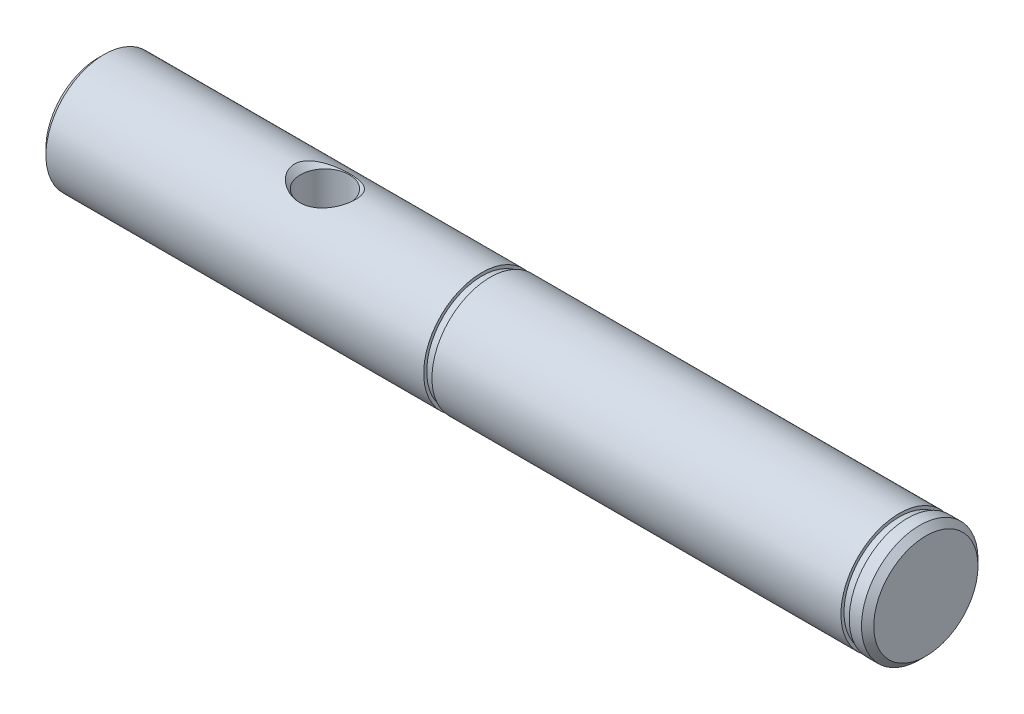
ISO-10303-21;
HEADER;
FILE_DESCRIPTION(('STEP AP214'),'2;1');
FILE_NAME('part.step','',(''),(''),'','','');
FILE_SCHEMA(('AUTOMOTIVE_DESIGN { 1 0 10303 214 1 1 1 1 }'));
ENDSEC;
DATA;
#1=APPLICATION_CONTEXT('core data for automotive mechanical design processes');
#2=APPLICATION_PROTOCOL_DEFINITION('international standard','automotive_design',2000,#1);
#3=PRODUCT_CONTEXT('',#1,'mechanical');
#4=PRODUCT('Part','Part','',(#3));
#5=PRODUCT_RELATED_PRODUCT_CATEGORY('part','',(#4));
#6=PRODUCT_DEFINITION_FORMATION('','',#4);
#7=PRODUCT_DEFINITION_CONTEXT('part definition',#1,'design');
#8=PRODUCT_DEFINITION('design','',#6,#7);
#9=PRODUCT_DEFINITION_SHAPE('','',#8);
#10=(LENGTH_UNIT() NAMED_UNIT(*) SI_UNIT(.MILLI.,.METRE.));
#11=(NAMED_UNIT(*) PLANE_ANGLE_UNIT() SI_UNIT($,.RADIAN.));
#12=(NAMED_UNIT(*) SI_UNIT($,.STERADIAN.) SOLID_ANGLE_UNIT());
#13=UNCERTAINTY_MEASURE_WITH_UNIT(LENGTH_MEASURE(1.E-05),#10,'distance_accuracy_value','');
#14=(GEOMETRIC_REPRESENTATION_CONTEXT(3) GLOBAL_UNCERTAINTY_ASSIGNED_CONTEXT((#13)) GLOBAL_UNIT_ASSIGNED_CONTEXT((#10,
#11,#12)) REPRESENTATION_CONTEXT('',''));
#15=CARTESIAN_POINT('',(0.,0.,0.));
#16=DIRECTION('',(0.,0.,1.));
#17=DIRECTION('',(1.,0.,0.));
#18=AXIS2_PLACEMENT_3D('',#15,#16,#17);
#19=CARTESIAN_POINT('',(1101.68249168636,472.076383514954,0.));
#20=DIRECTION('',(-1.,0.,0.));
#21=DIRECTION('',(0.,0.,1.));
#22=AXIS2_PLACEMENT_3D('',#19,#20,#21);
#23=CONICAL_SURFACE('',#22,8.5,0.785398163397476);
#24=CARTESIAN_POINT('',(1100.68249168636,472.076383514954,0.));
#25=DIRECTION('',(1.,0.,0.));
#26=DIRECTION('',(0.,0.,-1.));
#27=AXIS2_PLACEMENT_3D('',#24,#25,#26);
#28=CIRCLE('',#27,9.5);
#29=CARTESIAN_POINT('',(1100.68249168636,472.076383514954,-9.5));
#30=VERTEX_POINT('',#29);
#31=EDGE_CURVE('E28',#30,#30,#28,.T.);
#32=ORIENTED_EDGE('',*,*,#31,.T.);
#33=EDGE_LOOP('',(#32));
#34=FACE_BOUND('',#33,.T.);
#35=CARTESIAN_POINT('',(1101.68249168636,472.076383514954,0.));
#36=DIRECTION('',(1.,0.,0.));
#37=DIRECTION('',(0.,0.,-1.));
#38=AXIS2_PLACEMENT_3D('',#35,#36,#37);
#39=CIRCLE('',#38,8.5);
#40=CARTESIAN_POINT('',(1101.68249168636,472.076383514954,-8.5));
#41=VERTEX_POINT('',#40);
#42=EDGE_CURVE('E85',#41,#41,#39,.T.);
#43=ORIENTED_EDGE('',*,*,#42,.F.);
#44=EDGE_LOOP('',(#43));
#45=FACE_BOUND('',#44,.T.);
#46=ADVANCED_FACE('F14',(#34,#45),#23,.T.);
#47=CARTESIAN_POINT('',(1107.79950179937,472.076383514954,0.));
#48=DIRECTION('',(1.,0.,0.));
#49=DIRECTION('',(0.,0.,-1.));
#50=AXIS2_PLACEMENT_3D('',#47,#48,#49);
#51=CYLINDRICAL_SURFACE('',#50,9.5);
#52=CARTESIAN_POINT('',(1098.68249168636,472.076383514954,0.));
#53=DIRECTION('',(1.,0.,0.));
#54=DIRECTION('',(0.,0.,-1.));
#55=AXIS2_PLACEMENT_3D('',#52,#53,#54);
#56=CIRCLE('',#55,9.5);
#57=CARTESIAN_POINT('',(1098.68249168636,472.076383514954,-9.5));
#58=VERTEX_POINT('',#57);
#59=EDGE_CURVE('E32',#58,#58,#56,.T.);
#60=ORIENTED_EDGE('',*,*,#59,.T.);
#61=EDGE_LOOP('',(#60));
#62=FACE_BOUND('',#61,.T.);
#63=ORIENTED_EDGE('',*,*,#31,.F.);
#64=EDGE_LOOP('',(#63));
#65=FACE_BOUND('',#64,.T.);
#66=ADVANCED_FACE('F73',(#62,#65),#51,.T.);
#67=CARTESIAN_POINT('',(1098.68249168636,481.076383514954,0.));
#68=DIRECTION('',(-1.,0.,0.));
#69=DIRECTION('',(0.,0.,1.));
#70=AXIS2_PLACEMENT_3D('',#67,#68,#69);
#71=PLANE('',#70);
#72=CARTESIAN_POINT('',(1098.68249168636,472.076383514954,0.));
#73=DIRECTION('',(1.,0.,0.));
#74=DIRECTION('',(0.,0.,-1.));
#75=AXIS2_PLACEMENT_3D('',#72,#73,#74);
#76=CIRCLE('',#75,9.);
#77=CARTESIAN_POINT('',(1098.68249168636,472.076383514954,-9.));
#78=VERTEX_POINT('',#77);
#79=EDGE_CURVE('E116',#78,#78,#76,.T.);
#80=ORIENTED_EDGE('',*,*,#79,.T.);
#81=EDGE_LOOP('',(#80));
#82=FACE_BOUND('',#81,.T.);
#83=ORIENTED_EDGE('',*,*,#59,.F.);
#84=EDGE_LOOP('',(#83));
#85=FACE_BOUND('',#84,.T.);
#86=ADVANCED_FACE('F79',(#82,#85),#71,.T.);
#87=CARTESIAN_POINT('',(1107.79950179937,472.076383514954,0.));
#88=DIRECTION('',(1.,0.,0.));
#89=DIRECTION('',(0.,0.,-1.));
#90=AXIS2_PLACEMENT_3D('',#87,#88,#89);
#91=CYLINDRICAL_SURFACE('',#90,9.);
#92=CARTESIAN_POINT('',(1097.33249168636,472.076383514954,0.));
#93=DIRECTION('',(1.,0.,0.));
#94=DIRECTION('',(0.,0.,-1.));
#95=AXIS2_PLACEMENT_3D('',#92,#93,#94);
#96=CIRCLE('',#95,9.);
#97=CARTESIAN_POINT('',(1097.33249168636,472.076383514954,-9.));
#98=VERTEX_POINT('',#97);
#99=EDGE_CURVE('E113',#98,#98,#96,.T.);
#100=ORIENTED_EDGE('',*,*,#99,.T.);
#101=EDGE_LOOP('',(#100));
#102=FACE_BOUND('',#101,.T.);
#103=ORIENTED_EDGE('',*,*,#79,.F.);
#104=EDGE_LOOP('',(#103));
#105=FACE_BOUND('',#104,.T.);
#106=ADVANCED_FACE('F123',(#102,#105),#91,.T.);
#107=CARTESIAN_POINT('',(1097.33249168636,481.076383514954,0.));
#108=DIRECTION('',(1.,0.,0.));
#109=DIRECTION('',(0.,0.,-1.));
#110=AXIS2_PLACEMENT_3D('',#107,#108,#109);
#111=PLANE('',#110);
#112=CARTESIAN_POINT('',(1097.33249168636,472.076383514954,0.));
#113=DIRECTION('',(1.,0.,0.));
#114=DIRECTION('',(0.,0.,-1.));
#115=AXIS2_PLACEMENT_3D('',#112,#113,#114);
#116=CIRCLE('',#115,9.5);
#117=CARTESIAN_POINT('',(1097.33249168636,472.076383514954,-9.5));
#118=VERTEX_POINT('',#117);
#119=EDGE_CURVE('E110',#118,#118,#116,.T.);
#120=ORIENTED_EDGE('',*,*,#119,.T.);
#121=EDGE_LOOP('',(#120));
#122=FACE_BOUND('',#121,.T.);
#123=ORIENTED_EDGE('',*,*,#99,.F.);
#124=EDGE_LOOP('',(#123));
#125=FACE_BOUND('',#124,.T.);
#126=ADVANCED_FACE('F130',(#122,#125),#111,.T.);
#127=CARTESIAN_POINT('',(1107.79950179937,472.076383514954,0.));
#128=DIRECTION('',(1.,0.,0.));
#129=DIRECTION('',(0.,0.,-1.));
#130=AXIS2_PLACEMENT_3D('',#127,#128,#129);
#131=CYLINDRICAL_SURFACE('',#130,9.5);
#132=CARTESIAN_POINT('',(1030.63249168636,472.076383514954,0.));
#133=DIRECTION('',(1.,0.,0.));
#134=DIRECTION('',(0.,0.,-1.));
#135=AXIS2_PLACEMENT_3D('',#132,#133,#134);
#136=CIRCLE('',#135,9.5);
#137=CARTESIAN_POINT('',(1030.63249168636,472.076383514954,-9.5));
#138=VERTEX_POINT('',#137);
#139=EDGE_CURVE('E107',#138,#138,#136,.T.);
#140=ORIENTED_EDGE('',*,*,#139,.T.);
#141=EDGE_LOOP('',(#140));
#142=FACE_BOUND('',#141,.T.);
#143=ORIENTED_EDGE('',*,*,#119,.F.);
#144=EDGE_LOOP('',(#143));
#145=FACE_BOUND('',#144,.T.);
#146=ADVANCED_FACE('F136',(#142,#145),#131,.T.);
#147=CARTESIAN_POINT('',(1030.63249168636,481.076383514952,0.));
#148=DIRECTION('',(-1.,0.,0.));
#149=DIRECTION('',(0.,0.,1.));
#150=AXIS2_PLACEMENT_3D('',#147,#148,#149);
#151=PLANE('',#150);
#152=CARTESIAN_POINT('',(1030.63249168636,472.076383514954,0.));
#153=DIRECTION('',(1.,0.,0.));
#154=DIRECTION('',(0.,0.,-1.));
#155=AXIS2_PLACEMENT_3D('',#152,#153,#154);
#156=CIRCLE('',#155,8.99999999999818);
#157=CARTESIAN_POINT('',(1030.63249168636,472.076383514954,-8.99999999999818));
#158=VERTEX_POINT('',#157);
#159=EDGE_CURVE('E104',#158,#158,#156,.T.);
#160=ORIENTED_EDGE('',*,*,#159,.T.);
#161=EDGE_LOOP('',(#160));
#162=FACE_BOUND('',#161,.T.);
#163=ORIENTED_EDGE('',*,*,#139,.F.);
#164=EDGE_LOOP('',(#163));
#165=FACE_BOUND('',#164,.T.);
#166=ADVANCED_FACE('F140',(#162,#165),#151,.T.);
#167=CARTESIAN_POINT('',(1107.79950179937,472.076383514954,0.));
#168=DIRECTION('',(1.,0.,0.));
#169=DIRECTION('',(0.,0.,-1.));
#170=AXIS2_PLACEMENT_3D('',#167,#168,#169);
#171=CYLINDRICAL_SURFACE('',#170,8.99999999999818);
#172=CARTESIAN_POINT('',(1029.28249168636,472.076383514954,0.));
#173=DIRECTION('',(1.,0.,0.));
#174=DIRECTION('',(0.,0.,-1.));
#175=AXIS2_PLACEMENT_3D('',#172,#173,#174);
#176=CIRCLE('',#175,8.99999999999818);
#177=CARTESIAN_POINT('',(1029.28249168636,472.076383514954,-8.99999999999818));
#178=VERTEX_POINT('',#177);
#179=EDGE_CURVE('E101',#178,#178,#176,.T.);
#180=ORIENTED_EDGE('',*,*,#179,.T.);
#181=EDGE_LOOP('',(#180));
#182=FACE_BOUND('',#181,.T.);
#183=ORIENTED_EDGE('',*,*,#159,.F.);
#184=EDGE_LOOP('',(#183));
#185=FACE_BOUND('',#184,.T.);
#186=ADVANCED_FACE('F144',(#182,#185),#171,.T.);
#187=CARTESIAN_POINT('',(1029.28249168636,481.076383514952,0.));
#188=DIRECTION('',(1.,0.,0.));
#189=DIRECTION('',(0.,0.,-1.));
#190=AXIS2_PLACEMENT_3D('',#187,#188,#189);
#191=PLANE('',#190);
#192=CARTESIAN_POINT('',(1029.28249168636,472.076383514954,0.));
#193=DIRECTION('',(1.,0.,0.));
#194=DIRECTION('',(0.,0.,-1.));
#195=AXIS2_PLACEMENT_3D('',#192,#193,#194);
#196=CIRCLE('',#195,9.5);
#197=CARTESIAN_POINT('',(1029.28249168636,472.076383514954,-9.5));
#198=VERTEX_POINT('',#197);
#199=EDGE_CURVE('E98',#198,#198,#196,.T.);
#200=ORIENTED_EDGE('',*,*,#199,.T.);
#201=EDGE_LOOP('',(#200));
#202=FACE_BOUND('',#201,.T.);
#203=ORIENTED_EDGE('',*,*,#179,.F.);
#204=EDGE_LOOP('',(#203));
#205=FACE_BOUND('',#204,.T.);
#206=ADVANCED_FACE('F68',(#202,#205),#191,.T.);
#207=CARTESIAN_POINT('',(1107.79950179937,472.076383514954,0.));
#208=DIRECTION('',(1.,0.,0.));
#209=DIRECTION('',(0.,0.,-1.));
#210=AXIS2_PLACEMENT_3D('',#207,#208,#209);
#211=CYLINDRICAL_SURFACE('',#210,9.5);
#212=CARTESIAN_POINT('',(1000.37403693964,481.074378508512,-3.04730801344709));
#213=CARTESIAN_POINT('',(1000.19727511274,481.117710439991,-2.91935872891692));
#214=CARTESIAN_POINT('',(1000.02917467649,481.161981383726,-2.77970118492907));
#215=CARTESIAN_POINT('',(999.714703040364,481.249078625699,-2.47717407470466));
#216=CARTESIAN_POINT('',(999.568327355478,481.291905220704,-2.31430931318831));
#217=CARTESIAN_POINT('',(999.313974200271,481.368998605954,-1.98093142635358));
#218=CARTESIAN_POINT('',(999.20381103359,481.403681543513,-1.81219250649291));
#219=CARTESIAN_POINT('',(999.011513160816,481.465559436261,-1.45791499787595));
#220=CARTESIAN_POINT('',(998.929363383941,481.492758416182,-1.27238551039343));
#221=CARTESIAN_POINT('',(998.830822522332,481.525788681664,-0.984014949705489));
#222=CARTESIAN_POINT('',(998.802014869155,481.535530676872,-0.885736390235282));
#223=CARTESIAN_POINT('',(998.753389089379,481.552052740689,-0.686754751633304));
#224=CARTESIAN_POINT('',(998.733566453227,481.558834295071,-0.586052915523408));
#225=CARTESIAN_POINT('',(998.703343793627,481.569198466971,-0.383117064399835));
#226=CARTESIAN_POINT('',(998.692939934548,481.57278238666,-0.280883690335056));
#227=CARTESIAN_POINT('',(998.681760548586,481.576635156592,-0.0758644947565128));
#228=CARTESIAN_POINT('',(998.680983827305,481.576904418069,0.0269212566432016));
#229=CARTESIAN_POINT('',(998.692138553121,481.573055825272,0.308189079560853));
#230=CARTESIAN_POINT('',(998.713911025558,481.565540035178,0.486336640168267));
#231=CARTESIAN_POINT('',(998.785389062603,481.54114872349,0.83610471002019));
#232=CARTESIAN_POINT('',(998.835096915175,481.524272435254,1.00772468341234));
#233=CARTESIAN_POINT('',(998.95988881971,481.482672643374,1.3417373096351));
#234=CARTESIAN_POINT('',(999.035145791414,481.457895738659,1.50405803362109));
#235=CARTESIAN_POINT('',(999.207346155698,481.402613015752,1.81564069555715));
#236=CARTESIAN_POINT('',(999.304303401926,481.372103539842,1.9648942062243));
#237=CARTESIAN_POINT('',(999.561972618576,481.293628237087,2.3099206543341));
#238=CARTESIAN_POINT('',(999.732193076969,481.243787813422,2.49818929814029));
#239=CARTESIAN_POINT('',(1000.10128621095,481.142579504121,2.84370371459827));
#240=CARTESIAN_POINT('',(1000.30020391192,481.091209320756,3.00089979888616));
#241=CARTESIAN_POINT('',(1000.72278025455,480.991392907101,3.28567424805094));
#242=CARTESIAN_POINT('',(1000.9467338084,480.942994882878,3.41282907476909));
#243=CARTESIAN_POINT('',(1001.41172634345,480.854453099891,3.63452745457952));
#244=CARTESIAN_POINT('',(1001.65276185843,480.814307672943,3.7290776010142));
#245=CARTESIAN_POINT('',(1002.04319781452,480.760370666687,3.85237055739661));
#246=CARTESIAN_POINT('',(1002.18869226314,480.742583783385,3.89208918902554));
#247=CARTESIAN_POINT('',(1002.48277058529,480.711649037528,3.96025323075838));
#248=CARTESIAN_POINT('',(1002.63135360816,480.698499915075,3.98870170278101));
#249=CARTESIAN_POINT('',(1002.93065110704,480.677292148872,4.03422847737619));
#250=CARTESIAN_POINT('',(1003.08136621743,480.669235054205,4.05130331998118));
#251=CARTESIAN_POINT('',(1003.3838457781,480.65849920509,4.07399671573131));
#252=CARTESIAN_POINT('',(1003.53561020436,480.655820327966,4.07961553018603));
#253=CARTESIAN_POINT('',(1003.84116465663,480.655938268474,4.07936776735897));
#254=CARTESIAN_POINT('',(1003.99495455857,480.658808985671,4.07334618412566));
#255=CARTESIAN_POINT('',(1004.30141741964,480.670067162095,4.04953972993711));
#256=CARTESIAN_POINT('',(1004.45409034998,480.678454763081,4.03175455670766));
#257=CARTESIAN_POINT('',(1004.7572874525,480.700450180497,3.98448973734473));
#258=CARTESIAN_POINT('',(1004.90781100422,480.714059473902,3.95500678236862));
#259=CARTESIAN_POINT('',(1005.20562415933,480.746009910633,3.88446291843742));
#260=CARTESIAN_POINT('',(1005.35291254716,480.764352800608,3.84339773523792));
#261=CARTESIAN_POINT('',(1005.78834376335,480.825576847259,3.7030018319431));
#262=CARTESIAN_POINT('',(1006.0702923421,480.874672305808,3.58643359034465));
#263=CARTESIAN_POINT('',(1006.60877185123,480.98300773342,3.30820602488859));
#264=CARTESIAN_POINT('',(1006.86531439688,481.042243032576,3.14656743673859));
#265=CARTESIAN_POINT('',(1007.29454994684,481.150618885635,2.81636534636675));
#266=CARTESIAN_POINT('',(1007.47365516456,481.199342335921,2.6559996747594));
#267=CARTESIAN_POINT('',(1007.80349432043,481.293626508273,2.30756736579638));
#268=CARTESIAN_POINT('',(1007.95427169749,481.339192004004,2.11954394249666));
#269=CARTESIAN_POINT('',(1008.19383893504,481.413979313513,1.75686678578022));
#270=CARTESIAN_POINT('',(1008.28898133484,481.444656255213,1.58672406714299));
#271=CARTESIAN_POINT('',(1008.45107875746,481.497828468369,1.23223125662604));
#272=CARTESIAN_POINT('',(1008.51805252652,481.520329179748,1.04789071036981));
#273=CARTESIAN_POINT('',(1008.61976806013,481.554787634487,0.668116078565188));
#274=CARTESIAN_POINT('',(1008.65429481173,481.566675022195,0.472616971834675));
#275=CARTESIAN_POINT('',(1008.68750527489,481.578104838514,0.0782448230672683));
#276=CARTESIAN_POINT('',(1008.68620527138,481.577652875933,-0.120626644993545));
#277=CARTESIAN_POINT('',(1008.65002665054,481.565210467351,-0.493104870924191));
#278=CARTESIAN_POINT('',(1008.61878334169,481.554469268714,-0.66712388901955));
#279=CARTESIAN_POINT('',(1008.52998302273,481.524357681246,-1.00746737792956));
#280=CARTESIAN_POINT('',(1008.47242277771,481.50498623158,-1.1737909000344));
#281=CARTESIAN_POINT('',(1008.33140612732,481.458472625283,-1.50163731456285));
#282=CARTESIAN_POINT('',(1008.24702836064,481.431057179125,-1.66272086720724));
#283=CARTESIAN_POINT('',(1008.0570603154,481.371049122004,-1.9707547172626));
#284=CARTESIAN_POINT('',(1007.9514547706,481.338452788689,-2.11769473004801));
#285=CARTESIAN_POINT('',(1007.67124323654,481.25504087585,-2.45873837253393));
#286=CARTESIAN_POINT('',(1007.48691732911,481.202603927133,-2.64449032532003));
#287=CARTESIAN_POINT('',(1007.08993968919,481.097710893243,-2.98281005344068));
#288=CARTESIAN_POINT('',(1006.87724356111,481.045254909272,-3.13532481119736));
#289=CARTESIAN_POINT('',(1006.42759076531,480.945087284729,-3.4084443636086));
#290=CARTESIAN_POINT('',(1006.1903655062,480.897442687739,-3.52862914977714));
#291=CARTESIAN_POINT('',(1005.69959874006,480.812419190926,-3.73418163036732));
#292=CARTESIAN_POINT('',(1005.44606283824,480.775036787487,-3.81956121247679));
#293=CARTESIAN_POINT('',(1005.04003582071,480.72742743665,-3.92570388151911));
#294=CARTESIAN_POINT('',(1004.89111305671,480.712441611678,-3.95845483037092));
#295=CARTESIAN_POINT('',(1004.59073144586,480.687503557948,-4.01242004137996));
#296=CARTESIAN_POINT('',(1004.43927239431,480.677551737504,-4.03363336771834));
#297=CARTESIAN_POINT('',(1004.1348736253,480.663045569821,-4.06442135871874));
#298=CARTESIAN_POINT('',(1003.98193341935,480.65849306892,-4.07399204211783));
#299=CARTESIAN_POINT('',(1003.67570726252,480.654954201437,-4.0814388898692));
#300=CARTESIAN_POINT('',(1003.52242132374,480.655967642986,-4.07931545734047));
#301=CARTESIAN_POINT('',(1003.21628183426,480.663531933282,-4.06336798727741));
#302=CARTESIAN_POINT('',(1003.06342981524,480.670094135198,-4.04951996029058));
#303=CARTESIAN_POINT('',(1002.759498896,480.688536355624,-4.01014892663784));
#304=CARTESIAN_POINT('',(1002.60842076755,480.700418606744,-3.98462101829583));
#305=CARTESIAN_POINT('',(1002.3092652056,480.72907070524,-3.92201335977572));
#306=CARTESIAN_POINT('',(1002.16118559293,480.745836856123,-3.88494234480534));
#307=CARTESIAN_POINT('',(1001.86892463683,480.783680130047,-3.79936380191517));
#308=CARTESIAN_POINT('',(1001.72474407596,480.804758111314,-3.75085399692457));
#309=CARTESIAN_POINT('',(1001.36773506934,480.862409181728,-3.61438504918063));
#310=CARTESIAN_POINT('',(1001.15806378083,480.901350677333,-3.51901146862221));
#311=CARTESIAN_POINT('',(1000.7537790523,480.984646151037,-3.30246644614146));
#312=CARTESIAN_POINT('',(1000.55915800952,481.028997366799,-3.18130814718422));
#313=CARTESIAN_POINT('',(1000.37403693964,481.074378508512,-3.04730801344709));
#314=B_SPLINE_CURVE_WITH_KNOTS('',3,(#212,#213,#214,#215,#216,#217,#218,#219,#220,#221,#222,
#223,#224,#225,#226,#227,#228,#229,#230,#231,#232,#233,#234,#235,#236,#237,#238,#239,#240,#241,
#242,#243,#244,#245,#246,#247,#248,#249,#250,#251,#252,#253,#254,#255,#256,#257,#258,#259,#260,
#261,#262,#263,#264,#265,#266,#267,#268,#269,#270,#271,#272,#273,#274,#275,#276,#277,#278,#279,
#280,#281,#282,#283,#284,#285,#286,#287,#288,#289,#290,#291,#292,#293,#294,#295,#296,#297,#298,
#299,#300,#301,#302,#303,#304,#305,#306,#307,#308,#309,#310,#311,#312,#313),.UNSPECIFIED.,.T.,
.F.,(4,2,2,2,2,2,2,2,2,2,2,2,2,2,2,2,2,2,2,2,2,2,2,2,2,2,2,2,2,2,2,2,2,2,2,2,2,2,2,2,2,2,2,2,2,
2,2,2,2,2,4),(0.,0.666922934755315,1.33370799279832,1.9448158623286,2.55559444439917,
2.86383262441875,3.17191592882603,3.47987371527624,3.7877932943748,4.32383217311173,
4.85991496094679,5.39970085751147,5.93983234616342,6.71162964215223,7.48465131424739,
8.26799569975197,9.05118158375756,9.50632153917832,9.96133775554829,10.4164923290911,
10.8716365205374,11.332883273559,11.7941418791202,12.2555310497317,12.7170907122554,
13.6394892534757,14.561464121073,15.2946186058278,16.0266395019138,16.6163013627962,
17.2055701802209,17.7987168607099,18.391593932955,18.9205513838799,19.4495738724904,
19.9992025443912,20.549227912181,21.3455964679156,22.1432261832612,22.950766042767,
23.7580298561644,24.2172148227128,24.6764370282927,25.1358162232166,25.5951795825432,
26.0554851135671,26.5159839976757,26.9761352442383,27.436378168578,28.1351959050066,
28.833658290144),.UNSPECIFIED.);
#315=CARTESIAN_POINT('',(1000.37403693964,481.074378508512,-3.04730801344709));
#316=VERTEX_POINT('',#315);
#317=EDGE_CURVE('E10',#316,#316,#314,.T.);
#318=ORIENTED_EDGE('',*,*,#317,.F.);
#319=EDGE_LOOP('',(#318));
#320=FACE_BOUND('',#319,.T.);
#321=CARTESIAN_POINT('',(1000.37403693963,463.078388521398,-3.04730801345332));
#322=CARTESIAN_POINT('',(1000.61195260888,463.136707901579,-3.21952724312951));
#323=CARTESIAN_POINT('',(1000.86576135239,463.193370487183,-3.37067627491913));
#324=CARTESIAN_POINT('',(1001.39673170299,463.296277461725,-3.63033970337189));
#325=CARTESIAN_POINT('',(1001.67393600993,463.34250220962,-3.73877400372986));
#326=CARTESIAN_POINT('',(1002.10213526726,463.399777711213,-3.86893983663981));
#327=CARTESIAN_POINT('',(1002.24755503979,463.416904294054,-3.90700240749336));
#328=CARTESIAN_POINT('',(1002.54132584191,463.446486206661,-3.97192259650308));
#329=CARTESIAN_POINT('',(1002.68967586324,463.458943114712,-3.99878400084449));
#330=CARTESIAN_POINT('',(1002.98821752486,463.478748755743,-4.04119033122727));
#331=CARTESIAN_POINT('',(1003.13840793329,463.486100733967,-4.05674244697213));
#332=CARTESIAN_POINT('',(1003.43970138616,463.495455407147,-4.07649286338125));
#333=CARTESIAN_POINT('',(1003.59080442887,463.497458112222,-4.08069118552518));
#334=CARTESIAN_POINT('',(1003.89553279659,463.496029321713,-4.07768633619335));
#335=CARTESIAN_POINT('',(1004.04915572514,463.492501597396,-4.0702812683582));
#336=CARTESIAN_POINT('',(1004.35515705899,463.479961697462,-4.04372905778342));
#337=CARTESIAN_POINT('',(1004.50753543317,463.47094938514,-4.02458162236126));
#338=CARTESIAN_POINT('',(1004.81005969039,463.447755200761,-3.97461156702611));
#339=CARTESIAN_POINT('',(1004.96020433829,463.433570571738,-3.94378272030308));
#340=CARTESIAN_POINT('',(1005.25714187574,463.400538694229,-3.87056902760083));
#341=CARTESIAN_POINT('',(1005.40393350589,463.381689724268,-3.82817991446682));
#342=CARTESIAN_POINT('',(1005.83796337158,463.319037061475,-3.68375919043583));
#343=CARTESIAN_POINT('',(1006.11882170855,463.269130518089,-3.56447992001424));
#344=CARTESIAN_POINT('',(1006.65457142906,463.159588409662,-3.28081912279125));
#345=CARTESIAN_POINT('',(1006.90947736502,463.099958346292,-3.11646306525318));
#346=CARTESIAN_POINT('',(1007.33346962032,462.991757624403,-2.78270503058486));
#347=CARTESIAN_POINT('',(1007.50929480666,462.943521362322,-2.62175422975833));
#348=CARTESIAN_POINT('',(1007.83259186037,462.850476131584,-2.27268971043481));
#349=CARTESIAN_POINT('',(1007.98010721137,462.805661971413,-2.08461843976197));
#350=CARTESIAN_POINT('',(1008.21422892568,462.732272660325,-1.72189773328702));
#351=CARTESIAN_POINT('',(1008.30709131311,462.702231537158,-1.55159755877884));
#352=CARTESIAN_POINT('',(1008.46461931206,462.650421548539,-1.19716867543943));
#353=CARTESIAN_POINT('',(1008.52930364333,462.628647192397,-1.01304924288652));
#354=CARTESIAN_POINT('',(1008.62653544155,462.595660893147,-0.634203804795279));
#355=CARTESIAN_POINT('',(1008.65887614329,462.584516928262,-0.439417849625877));
#356=CARTESIAN_POINT('',(1008.68804308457,462.574474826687,-0.0468957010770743));
#357=CARTESIAN_POINT('',(1008.68488375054,462.57557171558,0.150839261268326));
#358=CARTESIAN_POINT('',(1008.64556645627,462.589087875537,0.521594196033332));
#359=CARTESIAN_POINT('',(1008.61288107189,462.600315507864,0.695042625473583));
#360=CARTESIAN_POINT('',(1008.52142146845,462.631293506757,1.03405522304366));
#361=CARTESIAN_POINT('',(1008.46264386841,462.651044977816,1.19961836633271));
#362=CARTESIAN_POINT('',(1008.31905403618,462.69832198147,1.52658765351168));
#363=CARTESIAN_POINT('',(1008.23321426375,462.726150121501,1.68749411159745));
#364=CARTESIAN_POINT('',(1008.04038745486,462.786894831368,1.99499974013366));
#365=CARTESIAN_POINT('',(1007.9333849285,462.819815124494,2.14158831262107));
#366=CARTESIAN_POINT('',(1007.64957699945,462.903972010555,2.4819236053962));
#367=CARTESIAN_POINT('',(1007.46303294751,462.956782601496,2.66719248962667));
#368=CARTESIAN_POINT('',(1007.06168428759,463.06217005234,3.00420738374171));
#369=CARTESIAN_POINT('',(1006.84683572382,463.114746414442,3.15590024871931));
#370=CARTESIAN_POINT('',(1006.39298331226,463.214851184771,3.42700443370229));
#371=CARTESIAN_POINT('',(1006.15371650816,463.262310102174,3.54599888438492));
#372=CARTESIAN_POINT('',(1005.65899388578,463.346640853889,3.74882925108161));
#373=CARTESIAN_POINT('',(1005.40354308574,463.383515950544,3.83267600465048));
#374=CARTESIAN_POINT('',(1004.99518317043,463.430026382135,3.93600301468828));
#375=CARTESIAN_POINT('',(1004.84577861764,463.444542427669,3.96763286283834));
#376=CARTESIAN_POINT('',(1004.54453377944,463.468484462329,4.01931648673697));
#377=CARTESIAN_POINT('',(1004.39269330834,463.477910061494,4.03936937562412));
#378=CARTESIAN_POINT('',(1004.08767846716,463.491322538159,4.06779686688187));
#379=CARTESIAN_POINT('',(1003.93450398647,463.495308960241,4.07617049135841));
#380=CARTESIAN_POINT('',(1003.62792076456,463.497699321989,4.08119916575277));
#381=CARTESIAN_POINT('',(1003.47451202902,463.496103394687,4.07785449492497));
#382=CARTESIAN_POINT('',(1003.1684961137,463.487384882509,4.05945876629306));
#383=CARTESIAN_POINT('',(1003.01588927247,463.480260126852,4.04440311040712));
#384=CARTESIAN_POINT('',(1002.71261931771,463.46073972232,4.00265041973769));
#385=CARTESIAN_POINT('',(1002.56195624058,463.448343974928,3.97595316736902));
#386=CARTESIAN_POINT('',(1002.26353977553,463.418708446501,3.91100255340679));
#387=CARTESIAN_POINT('',(1002.11578784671,463.401466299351,3.87274354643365));
#388=CARTESIAN_POINT('',(1001.8242796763,463.362738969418,3.78479651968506));
#389=CARTESIAN_POINT('',(1001.68052492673,463.341252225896,3.7351042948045));
#390=CARTESIAN_POINT('',(1001.25513005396,463.271193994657,3.56838824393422));
#391=CARTESIAN_POINT('',(1000.98090845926,463.217189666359,3.43405889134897));
#392=CARTESIAN_POINT('',(1000.46153752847,463.101852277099,3.1201954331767));
#393=CARTESIAN_POINT('',(1000.21636061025,463.040526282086,2.94070472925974));
#394=CARTESIAN_POINT('',(999.822186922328,462.93426651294,2.58777387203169));
#395=CARTESIAN_POINT('',(999.664493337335,462.889080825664,2.4241169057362));
#396=CARTESIAN_POINT('',(999.377320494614,462.803472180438,2.07260396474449));
#397=CARTESIAN_POINT('',(999.247797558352,462.763041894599,1.88478618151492));
#398=CARTESIAN_POINT('',(999.043694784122,462.697686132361,1.52240309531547));
#399=CARTESIAN_POINT('',(998.963460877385,462.671284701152,1.35130179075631));
#400=CARTESIAN_POINT('',(998.831237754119,462.627208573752,0.99739173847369));
#401=CARTESIAN_POINT('',(998.779230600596,462.609528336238,0.814590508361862));
#402=CARTESIAN_POINT('',(998.706770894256,462.584776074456,0.441074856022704));
#403=CARTESIAN_POINT('',(998.686479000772,462.577758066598,0.250325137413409));
#404=CARTESIAN_POINT('',(998.679575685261,462.575378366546,-0.131846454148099));
#405=CARTESIAN_POINT('',(998.692957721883,462.580014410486,-0.323268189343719));
#406=CARTESIAN_POINT('',(998.749824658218,462.599500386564,-0.684663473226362));
#407=CARTESIAN_POINT('',(998.790731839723,462.613475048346,-0.855102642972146));
#408=CARTESIAN_POINT('',(998.897461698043,462.649360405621,-1.18707391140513));
#409=CARTESIAN_POINT('',(998.963293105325,462.671273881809,-1.34860286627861));
#410=CARTESIAN_POINT('',(999.122086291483,462.722968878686,-1.67098284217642));
#411=CARTESIAN_POINT('',(999.21664550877,462.753199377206,-1.83096742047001));
#412=CARTESIAN_POINT('',(999.426538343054,462.818200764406,-2.1354925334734));
#413=CARTESIAN_POINT('',(999.541872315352,462.852971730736,-2.28003280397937));
#414=CARTESIAN_POINT('',(999.772370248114,462.919698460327,-2.53374170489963));
#415=CARTESIAN_POINT('',(999.885307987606,462.951369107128,-2.64503103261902));
#416=CARTESIAN_POINT('',(1000.1219660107,463.014983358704,-2.85536216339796));
#417=CARTESIAN_POINT('',(1000.24568882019,463.046927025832,-2.95440108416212));
#418=CARTESIAN_POINT('',(1000.37403693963,463.078388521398,-3.04730801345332));
#419=B_SPLINE_CURVE_WITH_KNOTS('',3,(#321,#322,#323,#324,#325,#326,#327,#328,#329,#330,#331,
#332,#333,#334,#335,#336,#337,#338,#339,#340,#341,#342,#343,#344,#345,#346,#347,#348,#349,#350,
#351,#352,#353,#354,#355,#356,#357,#358,#359,#360,#361,#362,#363,#364,#365,#366,#367,#368,#369,
#370,#371,#372,#373,#374,#375,#376,#377,#378,#379,#380,#381,#382,#383,#384,#385,#386,#387,#388,
#389,#390,#391,#392,#393,#394,#395,#396,#397,#398,#399,#400,#401,#402,#403,#404,#405,#406,#407,
#408,#409,#410,#411,#412,#413,#414,#415,#416,#417,#418),.UNSPECIFIED.,.T.,.F.,(4,2,2,2,2,2,2,2,
2,2,2,2,2,2,2,2,2,2,2,2,2,2,2,2,2,2,2,2,2,2,2,2,2,2,2,2,2,2,2,2,2,2,2,2,2,2,2,2,4),(0.,
0.897751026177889,1.79717754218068,2.25061958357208,2.70390822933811,3.15690845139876,
3.6099078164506,4.07087720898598,4.53185809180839,4.99308504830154,5.45448248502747,
6.37738240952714,7.29976194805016,8.02666340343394,8.75243924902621,9.33895017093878,
9.92507085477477,10.5149149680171,11.1045193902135,11.6326902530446,12.1609295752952,
12.7123053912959,13.2640862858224,14.0642649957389,14.8657013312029,15.6769253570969,
16.4878990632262,16.9476467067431,17.4074295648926,17.8672509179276,18.3270613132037,
18.7870523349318,19.2470519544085,19.707276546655,20.1676706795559,21.0931791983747,
22.0178016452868,22.710412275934,23.4019412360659,23.9720415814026,24.541779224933,
25.1143937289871,25.6868970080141,26.2121129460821,26.7375130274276,27.3003063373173,
27.8631092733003,28.3473043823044,28.8316131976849),.UNSPECIFIED.);
#420=CARTESIAN_POINT('',(1000.37403693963,463.078388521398,-3.04730801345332));
#421=VERTEX_POINT('',#420);
#422=EDGE_CURVE('E24',#421,#421,#419,.T.);
#423=ORIENTED_EDGE('',*,*,#422,.F.);
#424=EDGE_LOOP('',(#423));
#425=FACE_BOUND('',#424,.T.);
#426=CARTESIAN_POINT('',(967.68249168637,472.076383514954,0.));
#427=DIRECTION('',(1.,0.,0.));
#428=DIRECTION('',(0.,0.,-1.));
#429=AXIS2_PLACEMENT_3D('',#426,#427,#428);
#430=CIRCLE('',#429,9.5);
#431=CARTESIAN_POINT('',(967.68249168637,472.076383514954,-9.5));
#432=VERTEX_POINT('',#431);
#433=EDGE_CURVE('E89',#432,#432,#430,.T.);
#434=ORIENTED_EDGE('',*,*,#433,.T.);
#435=EDGE_LOOP('',(#434));
#436=FACE_BOUND('',#435,.T.);
#437=ORIENTED_EDGE('',*,*,#199,.F.);
#438=EDGE_LOOP('',(#437));
#439=FACE_BOUND('',#438,.T.);
#440=ADVANCED_FACE('F38',(#320,#425,#436,#439),#211,.T.);
#441=CARTESIAN_POINT('',(967.68249168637,472.076383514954,0.));
#442=DIRECTION('',(1.,0.,0.));
#443=DIRECTION('',(0.,0.,-1.));
#444=AXIS2_PLACEMENT_3D('',#441,#442,#443);
#445=CONICAL_SURFACE('',#444,9.5,0.785398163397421);
#446=CARTESIAN_POINT('',(966.68249168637,472.076383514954,0.));
#447=DIRECTION('',(1.,0.,0.));
#448=DIRECTION('',(0.,0.,-1.));
#449=AXIS2_PLACEMENT_3D('',#446,#447,#448);
#450=CIRCLE('',#449,8.5);
#451=CARTESIAN_POINT('',(966.68249168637,472.076383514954,-8.5));
#452=VERTEX_POINT('',#451);
#453=EDGE_CURVE('E86',#452,#452,#450,.T.);
#454=ORIENTED_EDGE('',*,*,#453,.T.);
#455=EDGE_LOOP('',(#454));
#456=FACE_BOUND('',#455,.T.);
#457=ORIENTED_EDGE('',*,*,#433,.F.);
#458=EDGE_LOOP('',(#457));
#459=FACE_BOUND('',#458,.T.);
#460=ADVANCED_FACE('F59',(#456,#459),#445,.T.);
#461=CARTESIAN_POINT('',(966.68249168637,480.576383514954,0.));
#462=DIRECTION('',(-1.,0.,0.));
#463=DIRECTION('',(0.,0.,1.));
#464=AXIS2_PLACEMENT_3D('',#461,#462,#463);
#465=PLANE('',#464);
#466=ORIENTED_EDGE('',*,*,#453,.F.);
#467=EDGE_LOOP('',(#466));
#468=FACE_BOUND('',#467,.T.);
#469=ADVANCED_FACE('F56',(#468),#465,.T.);
#470=CARTESIAN_POINT('',(1101.68249168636,480.576383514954,0.));
#471=DIRECTION('',(1.,0.,0.));
#472=DIRECTION('',(0.,0.,-1.));
#473=AXIS2_PLACEMENT_3D('',#470,#471,#472);
#474=PLANE('',#473);
#475=ORIENTED_EDGE('',*,*,#42,.T.);
#476=EDGE_LOOP('',(#475));
#477=FACE_BOUND('',#476,.T.);
#478=ADVANCED_FACE('F53',(#477),#474,.T.);
#479=CARTESIAN_POINT('',(1003.68249168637,481.576383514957,0.));
#480=DIRECTION('',(0.,1.,0.));
#481=DIRECTION('',(0.,0.,1.));
#482=AXIS2_PLACEMENT_3D('',#479,#480,#481);
#483=CONICAL_SURFACE('',#482,5.,0.785398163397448);
#484=ORIENTED_EDGE('',*,*,#317,.T.);
#485=EDGE_LOOP('',(#484));
#486=FACE_BOUND('',#485,.T.);
#487=CARTESIAN_POINT('',(1003.68249168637,480.576383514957,0.));
#488=DIRECTION('',(0.,1.,0.));
#489=DIRECTION('',(0.,0.,1.));
#490=AXIS2_PLACEMENT_3D('',#487,#488,#489);
#491=CIRCLE('',#490,4.);
#492=CARTESIAN_POINT('',(1003.68249168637,480.576383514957,4.));
#493=VERTEX_POINT('',#492);
#494=EDGE_CURVE('E87',#493,#493,#491,.T.);
#495=ORIENTED_EDGE('',*,*,#494,.F.);
#496=EDGE_LOOP('',(#495));
#497=FACE_BOUND('',#496,.T.);
#498=ADVANCED_FACE('F48',(#486,#497),#483,.F.);
#499=CARTESIAN_POINT('',(1003.68249168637,481.576383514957,0.));
#500=DIRECTION('',(0.,1.,0.));
#501=DIRECTION('',(0.,0.,1.));
#502=AXIS2_PLACEMENT_3D('',#499,#500,#501);
#503=CYLINDRICAL_SURFACE('',#502,4.);
#504=CARTESIAN_POINT('',(1003.68249168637,463.576383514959,0.));
#505=DIRECTION('',(0.,1.,0.));
#506=DIRECTION('',(0.,0.,1.));
#507=AXIS2_PLACEMENT_3D('',#504,#505,#506);
#508=CIRCLE('',#507,4.);
#509=CARTESIAN_POINT('',(1003.68249168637,463.576383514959,4.));
#510=VERTEX_POINT('',#509);
#511=EDGE_CURVE('E92',#510,#510,#508,.T.);
#512=ORIENTED_EDGE('',*,*,#511,.F.);
#513=EDGE_LOOP('',(#512));
#514=FACE_BOUND('',#513,.T.);
#515=ORIENTED_EDGE('',*,*,#494,.T.);
#516=EDGE_LOOP('',(#515));
#517=FACE_BOUND('',#516,.T.);
#518=ADVANCED_FACE('F46',(#514,#517),#503,.F.);
#519=CARTESIAN_POINT('',(1003.68249168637,463.576383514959,0.));
#520=DIRECTION('',(0.,-1.,0.));
#521=DIRECTION('',(0.,0.,-1.));
#522=AXIS2_PLACEMENT_3D('',#519,#520,#521);
#523=CONICAL_SURFACE('',#522,4.,0.785398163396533);
#524=ORIENTED_EDGE('',*,*,#422,.T.);
#525=EDGE_LOOP('',(#524));
#526=FACE_BOUND('',#525,.T.);
#527=ORIENTED_EDGE('',*,*,#511,.T.);
#528=EDGE_LOOP('',(#527));
#529=FACE_BOUND('',#528,.T.);
#530=ADVANCED_FACE('F42',(#526,#529),#523,.F.);
#531=CLOSED_SHELL('',(#46,#66,#86,#106,#126,#146,#166,#186,#206,#440,#460,#469,#478,#498,#518,#530));
#532=MANIFOLD_SOLID_BREP('B1',#531);
#533=ADVANCED_BREP_SHAPE_REPRESENTATION('',(#18,#532),#14);
#534=SHAPE_DEFINITION_REPRESENTATION(#9,#533);
ENDSEC;
END-ISO-10303-21;
